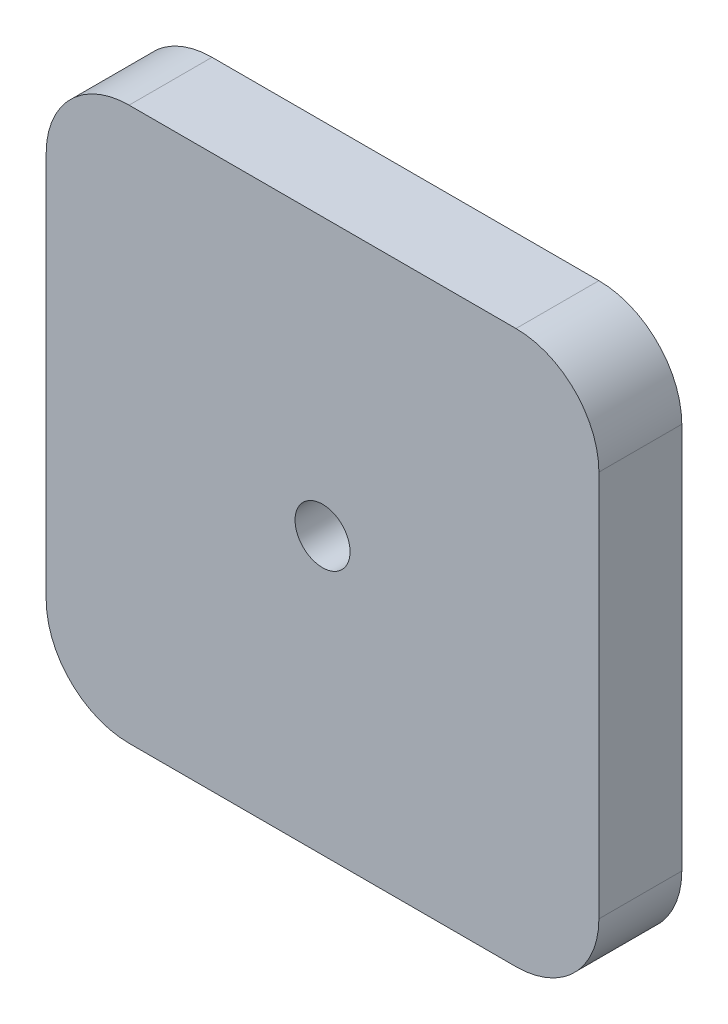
from build123d import *

# Parameters (mm, degrees)
SKETCH1_R           = 0.995386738
BOSS_EXTRUDE1_DEPTH = 3


with BuildPart() as part:
    # Sketch1 → Boss-Extrude1 (new body)
    with BuildSketch(Plane.XY):
        with BuildLine():
            Line((-234.342149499, 35.884414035), (-220.342149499, 35.884414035))
            ThreePointArc((-220.342149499, 35.884414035), (-218.220829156, 36.763093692), (-217.342149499, 38.884414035))
            Line((-217.342149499, 38.884414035), (-217.342149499, 52.884414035))
            ThreePointArc((-217.342149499, 52.884414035), (-218.220829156, 55.005734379), (-220.342149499, 55.884414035))
            Line((-220.342149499, 55.884414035), (-234.342149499, 55.884414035))
            ThreePointArc((-234.342149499, 55.884414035), (-236.463469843, 55.005734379), (-237.342149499, 52.884414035))
            Line((-237.342149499, 52.884414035), (-237.342149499, 38.884414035))
            ThreePointArc((-237.342149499, 38.884414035), (-236.463469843, 36.763093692), (-234.342149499, 35.884414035))
        make_face()
        with Locations((-227.342149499, 45.884414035)):
            Circle(SKETCH1_R, mode=Mode.SUBTRACT)
    extrude(amount=BOSS_EXTRUDE1_DEPTH)


solid = part.part
